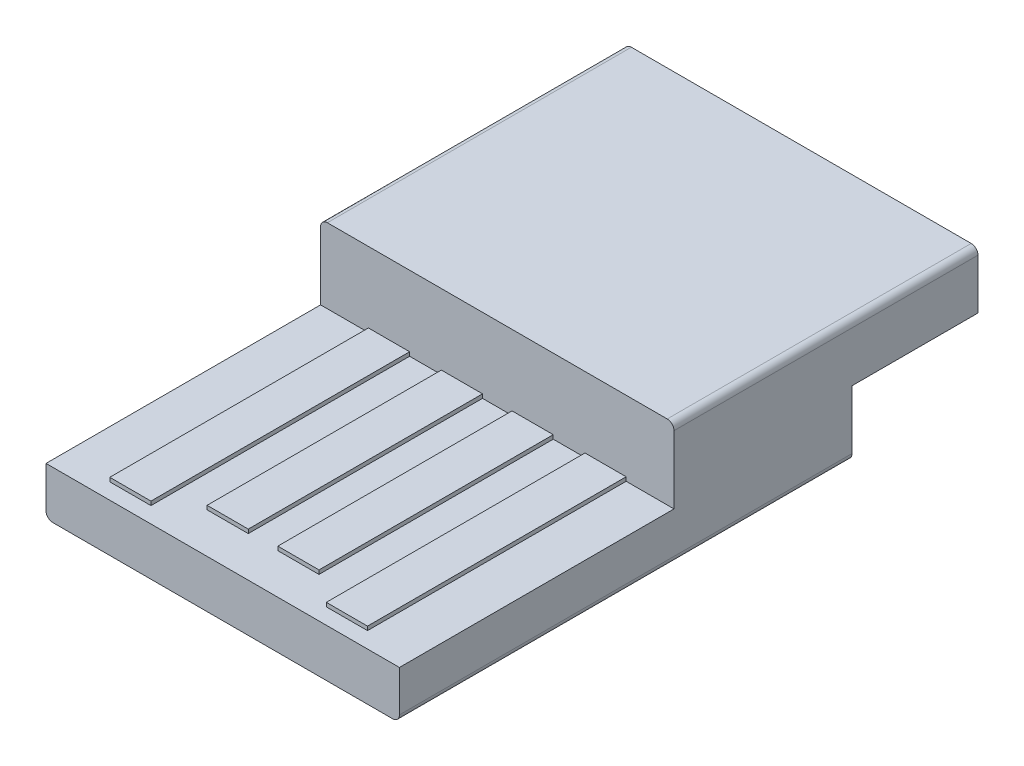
from build123d import *

# Parameters (mm, degrees)
EXTRUDE1_DEPTH = 8.89
EXTRUDE2_DEPTH = 5.7658
EXTRUDE3_DEPTH = 4.0767
SKETCH4_W      = 1.3335
SKETCH4_H      = 7.584103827
SKETCH4_H_2    = 8.374404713
EXTRUDE4_DEPTH = 0.127


with BuildPart() as part:
    # Sketch1 → Extrude1 (new body)
    with BuildSketch(Plane.XY):
        with BuildLine():
            Line((5.72135, -1.761717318), (5.72135, -0.4318))
            Line((5.72135, -0.4318), (-5.72135, -0.4318))
            Line((-5.72135, -0.4318), (-5.72135, -1.761717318))
            ThreePointArc((-5.72135, -1.761717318), (-5.657065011, -1.916915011), (-5.501867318, -1.9812))
            Line((-5.501867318, -1.9812), (-0.00635, -1.9812))
            Line((-0.00635, -1.9812), (0.00635, -1.9812))
            Line((0.00635, -1.9812), (5.501867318, -1.9812))
            ThreePointArc((5.501867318, -1.9812), (5.657065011, -1.916915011), (5.72135, -1.761717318))
        make_face()
    extrude(amount=-EXTRUDE1_DEPTH)

    # Sketch2 → Extrude2 (add)
    with BuildSketch(Plane(origin=(0, 0, -8.89), x_dir=(-1, 0, 0), z_dir=(0, 0, -1))):
        with BuildLine():
            Line((-5.501867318, 1.9812), (5.501867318, 1.9812))
            ThreePointArc((5.501867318, 1.9812), (5.657065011, 1.916915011), (5.72135, 1.761717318))
            Line((5.72135, 1.761717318), (5.72135, -1.761717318))
            ThreePointArc((5.72135, -1.761717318), (5.657065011, -1.916915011), (5.501867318, -1.9812))
            Line((5.501867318, -1.9812), (-5.501867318, -1.9812))
            ThreePointArc((-5.501867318, -1.9812), (-5.657065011, -1.916915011), (-5.72135, -1.761717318))
            Line((-5.72135, -1.761717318), (-5.72135, 1.761717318))
            ThreePointArc((-5.72135, 1.761717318), (-5.657065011, 1.916915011), (-5.501867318, 1.9812))
        make_face()
    extrude(amount=EXTRUDE2_DEPTH)

    # Sketch3 → Extrude3 (add)
    with BuildSketch(Plane(origin=(0, 0, -14.6558), x_dir=(-1, 0, 0), z_dir=(0, 0, -1))):
        with BuildLine():
            Line((-5.72135, 0.1397), (5.72135, 0.1397))
            Line((5.72135, 0.1397), (5.72135, 1.761717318))
            ThreePointArc((5.72135, 1.761717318), (5.657065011, 1.916915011), (5.501867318, 1.9812))
            Line((5.501867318, 1.9812), (-5.501867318, 1.9812))
            ThreePointArc((-5.501867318, 1.9812), (-5.657065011, 1.916915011), (-5.72135, 1.761717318))
            Line((-5.72135, 1.761717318), (-5.72135, 0.1397))
        make_face()
    extrude(amount=EXTRUDE3_DEPTH)

    # Sketch4 → Extrude4 (add)
    with BuildSketch(Plane(origin=(0, -0.4318, 0), x_dir=(1, 0, 0), z_dir=(0, 1, 0))):
        with Locations((1.14474092, 5.097948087)):
            Rectangle(SKETCH4_W, SKETCH4_H)
        with Locations((3.505473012, 4.702797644)):
            Rectangle(SKETCH4_W, SKETCH4_H_2)
        with Locations((-3.505473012, 4.702797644)):
            Rectangle(SKETCH4_W, SKETCH4_H_2)
        with Locations((-1.14474092, 5.097948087)):
            Rectangle(SKETCH4_W, SKETCH4_H)
    extrude(amount=EXTRUDE4_DEPTH)


solid = part.part
